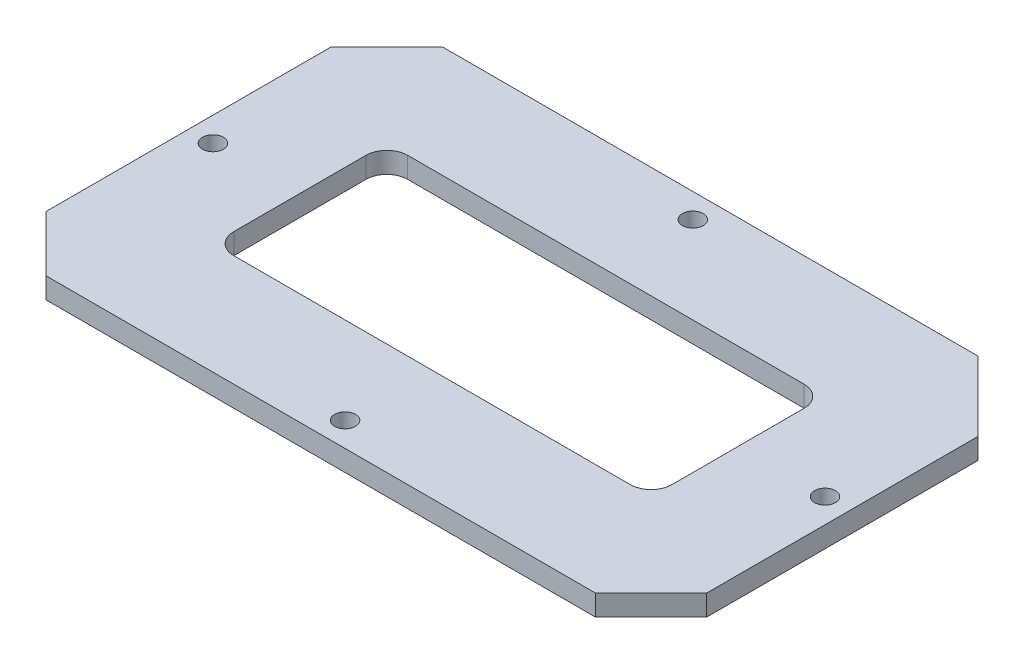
from build123d import *

# Parameters (mm, degrees)
SKIZZE1_R                       = 1.5
AUFSATZ_LINEAR_AUSTRAGEN1_DEPTH = 3


with BuildPart() as part:
    # Skizze1 → Aufsatz-Linear austragen1 (new body)
    with BuildSketch(Plane(origin=(0, 0, 0), x_dir=(1, 0, 0), z_dir=(0, 1, 0))):
        Polygon((37.5, 28.5), (47.5, 18.5), (47.5, -20.5), (39.5, -28.5), (-39.5, -28.5), (-47.5, -20.5), (-47.5, 20.5), (-39.5, 28.5), align=None)
        with Locations(Location((0, 25, 0), (0, 0, 270))):
            Circle(SKIZZE1_R, mode=Mode.SUBTRACT)
        with Locations(Location((0, -25, 0), (0, 0, 90))):
            Circle(SKIZZE1_R, mode=Mode.SUBTRACT)
        with Locations(Location((-44, 0, 0), (0, 0, 270))):
            Circle(SKIZZE1_R, mode=Mode.SUBTRACT)
        with Locations(Location((44, 0, 0), (0, 0, 90))):
            Circle(SKIZZE1_R, mode=Mode.SUBTRACT)
        with BuildLine():
            Line((-28.5, 12.5), (28.5, 12.5))
            ThreePointArc((28.5, 12.5), (30.621320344, 11.621320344), (31.5, 9.5))
            Line((31.5, 9.5), (31.5, -9.5))
            ThreePointArc((31.5, -9.5), (30.621320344, -11.621320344), (28.5, -12.5))
            Line((28.5, -12.5), (-28.5, -12.5))
            ThreePointArc((-28.5, -12.5), (-30.621320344, -11.621320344), (-31.5, -9.5))
            Line((-31.5, -9.5), (-31.5, 9.5))
            ThreePointArc((-31.5, 9.5), (-30.621320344, 11.621320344), (-28.5, 12.5))
        make_face(mode=Mode.SUBTRACT)
    extrude(amount=AUFSATZ_LINEAR_AUSTRAGEN1_DEPTH)


solid = part.part
